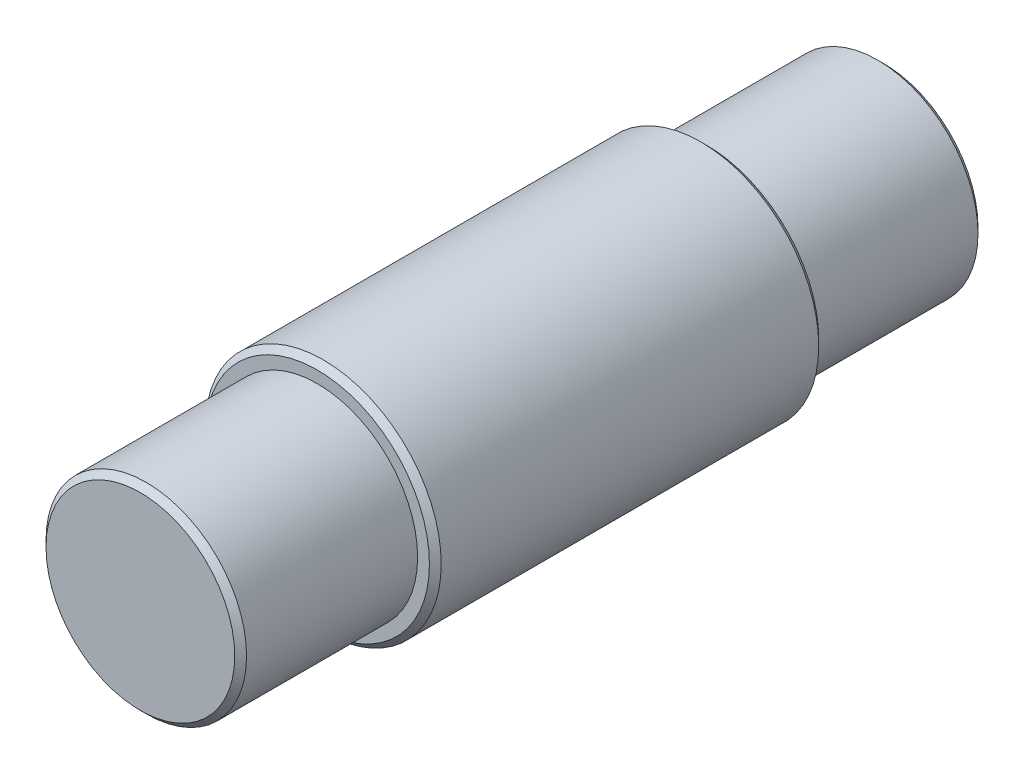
ISO-10303-21;
HEADER;
FILE_DESCRIPTION(('STEP AP214'),'2;1');
FILE_NAME('part.step','',(''),(''),'','','');
FILE_SCHEMA(('AUTOMOTIVE_DESIGN { 1 0 10303 214 1 1 1 1 }'));
ENDSEC;
DATA;
#1=APPLICATION_CONTEXT('core data for automotive mechanical design processes');
#2=APPLICATION_PROTOCOL_DEFINITION('international standard','automotive_design',2000,#1);
#3=PRODUCT_CONTEXT('',#1,'mechanical');
#4=PRODUCT('Part','Part','',(#3));
#5=PRODUCT_RELATED_PRODUCT_CATEGORY('part','',(#4));
#6=PRODUCT_DEFINITION_FORMATION('','',#4);
#7=PRODUCT_DEFINITION_CONTEXT('part definition',#1,'design');
#8=PRODUCT_DEFINITION('design','',#6,#7);
#9=PRODUCT_DEFINITION_SHAPE('','',#8);
#10=(LENGTH_UNIT() NAMED_UNIT(*) SI_UNIT(.MILLI.,.METRE.));
#11=(NAMED_UNIT(*) PLANE_ANGLE_UNIT() SI_UNIT($,.RADIAN.));
#12=(NAMED_UNIT(*) SI_UNIT($,.STERADIAN.) SOLID_ANGLE_UNIT());
#13=UNCERTAINTY_MEASURE_WITH_UNIT(LENGTH_MEASURE(1.E-05),#10,'distance_accuracy_value','');
#14=(GEOMETRIC_REPRESENTATION_CONTEXT(3) GLOBAL_UNCERTAINTY_ASSIGNED_CONTEXT((#13)) GLOBAL_UNIT_ASSIGNED_CONTEXT((#10,
#11,#12)) REPRESENTATION_CONTEXT('',''));
#15=CARTESIAN_POINT('',(0.,0.,0.));
#16=DIRECTION('',(0.,0.,1.));
#17=DIRECTION('',(1.,0.,0.));
#18=AXIS2_PLACEMENT_3D('',#15,#16,#17);
#19=CARTESIAN_POINT('',(0.,0.,-12.5));
#20=DIRECTION('',(0.,0.,1.));
#21=DIRECTION('',(1.,0.,0.));
#22=AXIS2_PLACEMENT_3D('',#19,#20,#21);
#23=CONICAL_SURFACE('',#22,8.50000000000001,0.785398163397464);
#24=CARTESIAN_POINT('',(0.,0.,-13.));
#25=DIRECTION('',(0.,0.,1.));
#26=DIRECTION('',(1.,0.,0.));
#27=AXIS2_PLACEMENT_3D('',#24,#25,#26);
#28=CIRCLE('',#27,7.99999999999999);
#29=CARTESIAN_POINT('',(7.99999999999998,0.,-13.));
#30=VERTEX_POINT('',#29);
#31=EDGE_CURVE('E84',#30,#30,#28,.T.);
#32=ORIENTED_EDGE('',*,*,#31,.T.);
#33=EDGE_LOOP('',(#32));
#34=FACE_BOUND('',#33,.T.);
#35=CARTESIAN_POINT('',(0.,0.,-12.5));
#36=DIRECTION('',(0.,0.,1.));
#37=DIRECTION('',(1.,0.,0.));
#38=AXIS2_PLACEMENT_3D('',#35,#36,#37);
#39=CIRCLE('',#38,8.50000000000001);
#40=CARTESIAN_POINT('',(8.5,0.,-12.5));
#41=VERTEX_POINT('',#40);
#42=EDGE_CURVE('E10',#41,#41,#39,.T.);
#43=ORIENTED_EDGE('',*,*,#42,.F.);
#44=EDGE_LOOP('',(#43));
#45=FACE_BOUND('',#44,.T.);
#46=ADVANCED_FACE('F39',(#34,#45),#23,.T.);
#47=CARTESIAN_POINT('',(0.,0.,-13.));
#48=DIRECTION('',(0.,0.,1.));
#49=DIRECTION('',(1.,0.,0.));
#50=AXIS2_PLACEMENT_3D('',#47,#48,#49);
#51=CYLINDRICAL_SURFACE('',#50,8.5);
#52=ORIENTED_EDGE('',*,*,#42,.T.);
#53=EDGE_LOOP('',(#52));
#54=FACE_BOUND('',#53,.T.);
#55=CARTESIAN_POINT('',(0.,0.,2.));
#56=DIRECTION('',(0.,0.,1.));
#57=DIRECTION('',(1.,0.,0.));
#58=AXIS2_PLACEMENT_3D('',#55,#56,#57);
#59=CIRCLE('',#58,8.5);
#60=CARTESIAN_POINT('',(8.5,0.,2.));
#61=VERTEX_POINT('',#60);
#62=EDGE_CURVE('E46',#61,#61,#59,.T.);
#63=ORIENTED_EDGE('',*,*,#62,.F.);
#64=EDGE_LOOP('',(#63));
#65=FACE_BOUND('',#64,.T.);
#66=ADVANCED_FACE('F103',(#54,#65),#51,.T.);
#67=CARTESIAN_POINT('',(9.49999999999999,0.,2.));
#68=DIRECTION('',(0.,0.,-1.));
#69=DIRECTION('',(-1.,0.,0.));
#70=AXIS2_PLACEMENT_3D('',#67,#68,#69);
#71=PLANE('',#70);
#72=ORIENTED_EDGE('',*,*,#62,.T.);
#73=EDGE_LOOP('',(#72));
#74=FACE_BOUND('',#73,.T.);
#75=CARTESIAN_POINT('',(0.,0.,2.));
#76=DIRECTION('',(0.,0.,1.));
#77=DIRECTION('',(1.,0.,0.));
#78=AXIS2_PLACEMENT_3D('',#75,#76,#77);
#79=CIRCLE('',#78,9.49999999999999);
#80=CARTESIAN_POINT('',(9.49999999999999,0.,2.));
#81=VERTEX_POINT('',#80);
#82=EDGE_CURVE('E52',#81,#81,#79,.T.);
#83=ORIENTED_EDGE('',*,*,#82,.F.);
#84=EDGE_LOOP('',(#83));
#85=FACE_BOUND('',#84,.T.);
#86=ADVANCED_FACE('F107',(#74,#85),#71,.T.);
#87=CARTESIAN_POINT('',(0.,0.,2.5));
#88=DIRECTION('',(0.,0.,1.));
#89=DIRECTION('',(1.,0.,0.));
#90=AXIS2_PLACEMENT_3D('',#87,#88,#89);
#91=CONICAL_SURFACE('',#90,10.,0.785398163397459);
#92=ORIENTED_EDGE('',*,*,#82,.T.);
#93=EDGE_LOOP('',(#92));
#94=FACE_BOUND('',#93,.T.);
#95=CARTESIAN_POINT('',(0.,0.,2.5));
#96=DIRECTION('',(0.,0.,1.));
#97=DIRECTION('',(1.,0.,0.));
#98=AXIS2_PLACEMENT_3D('',#95,#96,#97);
#99=CIRCLE('',#98,10.);
#100=CARTESIAN_POINT('',(10.,0.,2.5));
#101=VERTEX_POINT('',#100);
#102=EDGE_CURVE('E58',#101,#101,#99,.T.);
#103=ORIENTED_EDGE('',*,*,#102,.F.);
#104=EDGE_LOOP('',(#103));
#105=FACE_BOUND('',#104,.T.);
#106=ADVANCED_FACE('F111',(#94,#105),#91,.T.);
#107=CARTESIAN_POINT('',(0.,0.,-13.));
#108=DIRECTION('',(0.,0.,1.));
#109=DIRECTION('',(1.,0.,0.));
#110=AXIS2_PLACEMENT_3D('',#107,#108,#109);
#111=CYLINDRICAL_SURFACE('',#110,10.);
#112=ORIENTED_EDGE('',*,*,#102,.T.);
#113=EDGE_LOOP('',(#112));
#114=FACE_BOUND('',#113,.T.);
#115=CARTESIAN_POINT('',(0.,0.,34.5));
#116=DIRECTION('',(0.,0.,1.));
#117=DIRECTION('',(1.,0.,0.));
#118=AXIS2_PLACEMENT_3D('',#115,#116,#117);
#119=CIRCLE('',#118,10.);
#120=CARTESIAN_POINT('',(10.,0.,34.5));
#121=VERTEX_POINT('',#120);
#122=EDGE_CURVE('E64',#121,#121,#119,.T.);
#123=ORIENTED_EDGE('',*,*,#122,.F.);
#124=EDGE_LOOP('',(#123));
#125=FACE_BOUND('',#124,.T.);
#126=ADVANCED_FACE('F117',(#114,#125),#111,.T.);
#127=CARTESIAN_POINT('',(0.,0.,35.));
#128=DIRECTION('',(0.,0.,-1.));
#129=DIRECTION('',(-1.,0.,0.));
#130=AXIS2_PLACEMENT_3D('',#127,#128,#129);
#131=CONICAL_SURFACE('',#130,9.5,0.78539816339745);
#132=ORIENTED_EDGE('',*,*,#122,.T.);
#133=EDGE_LOOP('',(#132));
#134=FACE_BOUND('',#133,.T.);
#135=CARTESIAN_POINT('',(0.,0.,35.));
#136=DIRECTION('',(0.,0.,1.));
#137=DIRECTION('',(1.,0.,0.));
#138=AXIS2_PLACEMENT_3D('',#135,#136,#137);
#139=CIRCLE('',#138,9.5);
#140=CARTESIAN_POINT('',(9.5,0.,35.));
#141=VERTEX_POINT('',#140);
#142=EDGE_CURVE('E68',#141,#141,#139,.T.);
#143=ORIENTED_EDGE('',*,*,#142,.F.);
#144=EDGE_LOOP('',(#143));
#145=FACE_BOUND('',#144,.T.);
#146=ADVANCED_FACE('F121',(#134,#145),#131,.T.);
#147=CARTESIAN_POINT('',(8.5,0.,35.));
#148=DIRECTION('',(0.,0.,1.));
#149=DIRECTION('',(1.,0.,0.));
#150=AXIS2_PLACEMENT_3D('',#147,#148,#149);
#151=PLANE('',#150);
#152=ORIENTED_EDGE('',*,*,#142,.T.);
#153=EDGE_LOOP('',(#152));
#154=FACE_BOUND('',#153,.T.);
#155=CARTESIAN_POINT('',(0.,0.,35.));
#156=DIRECTION('',(0.,0.,1.));
#157=DIRECTION('',(1.,0.,0.));
#158=AXIS2_PLACEMENT_3D('',#155,#156,#157);
#159=CIRCLE('',#158,8.5);
#160=CARTESIAN_POINT('',(8.5,0.,35.));
#161=VERTEX_POINT('',#160);
#162=EDGE_CURVE('E72',#161,#161,#159,.T.);
#163=ORIENTED_EDGE('',*,*,#162,.F.);
#164=EDGE_LOOP('',(#163));
#165=FACE_BOUND('',#164,.T.);
#166=ADVANCED_FACE('F125',(#154,#165),#151,.T.);
#167=CARTESIAN_POINT('',(0.,0.,-13.));
#168=DIRECTION('',(0.,0.,1.));
#169=DIRECTION('',(1.,0.,0.));
#170=AXIS2_PLACEMENT_3D('',#167,#168,#169);
#171=CYLINDRICAL_SURFACE('',#170,8.5);
#172=ORIENTED_EDGE('',*,*,#162,.T.);
#173=EDGE_LOOP('',(#172));
#174=FACE_BOUND('',#173,.T.);
#175=CARTESIAN_POINT('',(0.,0.,49.5));
#176=DIRECTION('',(0.,0.,1.));
#177=DIRECTION('',(1.,0.,0.));
#178=AXIS2_PLACEMENT_3D('',#175,#176,#177);
#179=CIRCLE('',#178,8.5);
#180=CARTESIAN_POINT('',(8.5,0.,49.5));
#181=VERTEX_POINT('',#180);
#182=EDGE_CURVE('E76',#181,#181,#179,.T.);
#183=ORIENTED_EDGE('',*,*,#182,.F.);
#184=EDGE_LOOP('',(#183));
#185=FACE_BOUND('',#184,.T.);
#186=ADVANCED_FACE('F129',(#174,#185),#171,.T.);
#187=CARTESIAN_POINT('',(0.,0.,50.));
#188=DIRECTION('',(0.,0.,-1.));
#189=DIRECTION('',(-1.,0.,0.));
#190=AXIS2_PLACEMENT_3D('',#187,#188,#189);
#191=CONICAL_SURFACE('',#190,8.,0.785398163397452);
#192=ORIENTED_EDGE('',*,*,#182,.T.);
#193=EDGE_LOOP('',(#192));
#194=FACE_BOUND('',#193,.T.);
#195=CARTESIAN_POINT('',(0.,0.,50.));
#196=DIRECTION('',(0.,0.,1.));
#197=DIRECTION('',(1.,0.,0.));
#198=AXIS2_PLACEMENT_3D('',#195,#196,#197);
#199=CIRCLE('',#198,8.);
#200=CARTESIAN_POINT('',(8.,0.,50.));
#201=VERTEX_POINT('',#200);
#202=EDGE_CURVE('E80',#201,#201,#199,.T.);
#203=ORIENTED_EDGE('',*,*,#202,.F.);
#204=EDGE_LOOP('',(#203));
#205=FACE_BOUND('',#204,.T.);
#206=ADVANCED_FACE('F99',(#194,#205),#191,.T.);
#207=CARTESIAN_POINT('',(0.,0.,50.));
#208=DIRECTION('',(0.,0.,1.));
#209=DIRECTION('',(1.,0.,0.));
#210=AXIS2_PLACEMENT_3D('',#207,#208,#209);
#211=PLANE('',#210);
#212=ORIENTED_EDGE('',*,*,#202,.T.);
#213=EDGE_LOOP('',(#212));
#214=FACE_BOUND('',#213,.T.);
#215=ADVANCED_FACE('F94',(#214),#211,.T.);
#216=CARTESIAN_POINT('',(7.99999999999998,0.,-13.));
#217=DIRECTION('',(0.,0.,-1.));
#218=DIRECTION('',(-1.,0.,0.));
#219=AXIS2_PLACEMENT_3D('',#216,#217,#218);
#220=PLANE('',#219);
#221=ORIENTED_EDGE('',*,*,#31,.F.);
#222=EDGE_LOOP('',(#221));
#223=FACE_BOUND('',#222,.T.);
#224=ADVANCED_FACE('F92',(#223),#220,.T.);
#225=CLOSED_SHELL('',(#46,#66,#86,#106,#126,#146,#166,#186,#206,#215,#224));
#226=MANIFOLD_SOLID_BREP('B2',#225);
#227=ADVANCED_BREP_SHAPE_REPRESENTATION('',(#18,#226),#14);
#228=SHAPE_DEFINITION_REPRESENTATION(#9,#227);
ENDSEC;
END-ISO-10303-21;
